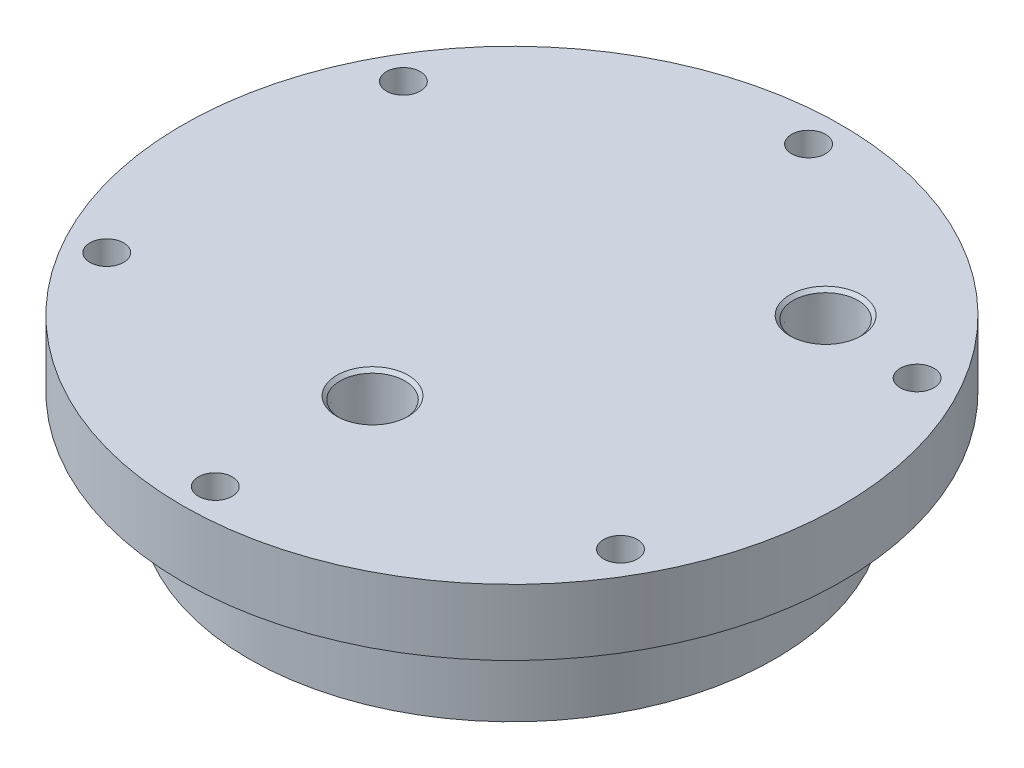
ISO-10303-21;
HEADER;
FILE_DESCRIPTION(('STEP AP214'),'2;1');
FILE_NAME('part.step','',(''),(''),'','','');
FILE_SCHEMA(('AUTOMOTIVE_DESIGN { 1 0 10303 214 1 1 1 1 }'));
ENDSEC;
DATA;
#1=APPLICATION_CONTEXT('core data for automotive mechanical design processes');
#2=APPLICATION_PROTOCOL_DEFINITION('international standard','automotive_design',2000,#1);
#3=PRODUCT_CONTEXT('',#1,'mechanical');
#4=PRODUCT('Part','Part','',(#3));
#5=PRODUCT_RELATED_PRODUCT_CATEGORY('part','',(#4));
#6=PRODUCT_DEFINITION_FORMATION('','',#4);
#7=PRODUCT_DEFINITION_CONTEXT('part definition',#1,'design');
#8=PRODUCT_DEFINITION('design','',#6,#7);
#9=PRODUCT_DEFINITION_SHAPE('','',#8);
#10=(LENGTH_UNIT() NAMED_UNIT(*) SI_UNIT(.MILLI.,.METRE.));
#11=(NAMED_UNIT(*) PLANE_ANGLE_UNIT() SI_UNIT($,.RADIAN.));
#12=(NAMED_UNIT(*) SI_UNIT($,.STERADIAN.) SOLID_ANGLE_UNIT());
#13=UNCERTAINTY_MEASURE_WITH_UNIT(LENGTH_MEASURE(1.E-05),#10,'distance_accuracy_value','');
#14=(GEOMETRIC_REPRESENTATION_CONTEXT(3) GLOBAL_UNCERTAINTY_ASSIGNED_CONTEXT((#13)) GLOBAL_UNIT_ASSIGNED_CONTEXT((#10,
#11,#12)) REPRESENTATION_CONTEXT('',''));
#15=CARTESIAN_POINT('',(0.,0.,0.));
#16=DIRECTION('',(0.,0.,1.));
#17=DIRECTION('',(1.,0.,0.));
#18=AXIS2_PLACEMENT_3D('',#15,#16,#17);
#19=CARTESIAN_POINT('',(0.,0.,0.));
#20=DIRECTION('',(0.,1.,0.));
#21=DIRECTION('',(0.,0.,1.));
#22=AXIS2_PLACEMENT_3D('',#19,#20,#21);
#23=PLANE('',#22);
#24=CARTESIAN_POINT('',(0.,0.,0.));
#25=DIRECTION('',(0.,-1.,0.));
#26=DIRECTION('',(0.,0.,-1.));
#27=AXIS2_PLACEMENT_3D('',#24,#25,#26);
#28=CIRCLE('',#27,36.3855);
#29=CARTESIAN_POINT('',(0.,0.,-36.3855));
#30=VERTEX_POINT('',#29);
#31=EDGE_CURVE('E98',#30,#30,#28,.T.);
#32=ORIENTED_EDGE('',*,*,#31,.T.);
#33=EDGE_LOOP('',(#32));
#34=FACE_BOUND('',#33,.T.);
#35=CARTESIAN_POINT('',(0.,0.,0.));
#36=DIRECTION('',(0.,-1.,0.));
#37=DIRECTION('',(0.,0.,-1.));
#38=AXIS2_PLACEMENT_3D('',#35,#36,#37);
#39=CIRCLE('',#38,33.2105);
#40=CARTESIAN_POINT('',(0.,0.,-33.2105));
#41=VERTEX_POINT('',#40);
#42=EDGE_CURVE('E95',#41,#41,#39,.T.);
#43=ORIENTED_EDGE('',*,*,#42,.F.);
#44=EDGE_LOOP('',(#43));
#45=FACE_BOUND('',#44,.T.);
#46=ADVANCED_FACE('F30',(#34,#45),#23,.F.);
#47=CARTESIAN_POINT('',(0.,0.,0.));
#48=DIRECTION('',(0.,-1.,0.));
#49=DIRECTION('',(0.,0.,-1.));
#50=AXIS2_PLACEMENT_3D('',#47,#48,#49);
#51=CYLINDRICAL_SURFACE('',#50,20.5105);
#52=CARTESIAN_POINT('',(0.,0.,0.));
#53=DIRECTION('',(0.,-1.,0.));
#54=DIRECTION('',(0.,0.,-1.));
#55=AXIS2_PLACEMENT_3D('',#52,#53,#54);
#56=CIRCLE('',#55,20.5105);
#57=CARTESIAN_POINT('',(0.,0.,-20.5105));
#58=VERTEX_POINT('',#57);
#59=EDGE_CURVE('E86',#58,#58,#56,.T.);
#60=ORIENTED_EDGE('',*,*,#59,.F.);
#61=EDGE_LOOP('',(#60));
#62=FACE_BOUND('',#61,.T.);
#63=CARTESIAN_POINT('',(0.,15.875,0.));
#64=DIRECTION('',(0.,-1.,0.));
#65=DIRECTION('',(0.,0.,-1.));
#66=AXIS2_PLACEMENT_3D('',#63,#64,#65);
#67=CIRCLE('',#66,20.5105);
#68=CARTESIAN_POINT('',(0.,15.875,-20.5105));
#69=VERTEX_POINT('',#68);
#70=EDGE_CURVE('E89',#69,#69,#67,.T.);
#71=ORIENTED_EDGE('',*,*,#70,.T.);
#72=EDGE_LOOP('',(#71));
#73=FACE_BOUND('',#72,.T.);
#74=ADVANCED_FACE('F188',(#62,#73),#51,.T.);
#75=CARTESIAN_POINT('',(20.5105,15.875,0.));
#76=DIRECTION('',(0.,1.,0.));
#77=DIRECTION('',(0.,0.,1.));
#78=AXIS2_PLACEMENT_3D('',#75,#76,#77);
#79=PLANE('',#78);
#80=CARTESIAN_POINT('',(0.,15.875,26.8605));
#81=DIRECTION('',(0.,1.,0.));
#82=DIRECTION('',(0.,0.,1.));
#83=AXIS2_PLACEMENT_3D('',#80,#81,#82);
#84=CIRCLE('',#83,5.5626);
#85=CARTESIAN_POINT('',(0.,15.875,32.4231));
#86=VERTEX_POINT('',#85);
#87=EDGE_CURVE('E125',#86,#86,#84,.T.);
#88=ORIENTED_EDGE('',*,*,#87,.T.);
#89=EDGE_LOOP('',(#88));
#90=FACE_BOUND('',#89,.T.);
#91=ORIENTED_EDGE('',*,*,#70,.F.);
#92=EDGE_LOOP('',(#91));
#93=FACE_BOUND('',#92,.T.);
#94=CARTESIAN_POINT('',(0.,15.875,0.));
#95=DIRECTION('',(0.,-1.,0.));
#96=DIRECTION('',(0.,0.,-1.));
#97=AXIS2_PLACEMENT_3D('',#94,#95,#96);
#98=CIRCLE('',#97,33.2105);
#99=CARTESIAN_POINT('',(0.,15.875,-33.2105));
#100=VERTEX_POINT('',#99);
#101=EDGE_CURVE('E92',#100,#100,#98,.T.);
#102=ORIENTED_EDGE('',*,*,#101,.T.);
#103=EDGE_LOOP('',(#102));
#104=FACE_BOUND('',#103,.T.);
#105=ADVANCED_FACE('F194',(#90,#93,#104),#79,.F.);
#106=CARTESIAN_POINT('',(0.,0.,0.));
#107=DIRECTION('',(0.,-1.,0.));
#108=DIRECTION('',(0.,0.,-1.));
#109=AXIS2_PLACEMENT_3D('',#106,#107,#108);
#110=CYLINDRICAL_SURFACE('',#109,33.2105);
#111=ORIENTED_EDGE('',*,*,#101,.F.);
#112=EDGE_LOOP('',(#111));
#113=FACE_BOUND('',#112,.T.);
#114=ORIENTED_EDGE('',*,*,#42,.T.);
#115=EDGE_LOOP('',(#114));
#116=FACE_BOUND('',#115,.T.);
#117=ADVANCED_FACE('F200',(#113,#116),#110,.F.);
#118=ORIENTED_EDGE('',*,*,#59,.T.);
#119=EDGE_LOOP('',(#118));
#120=FACE_BOUND('',#119,.T.);
#121=ADVANCED_FACE('F190',(#120),#23,.F.);
#122=CARTESIAN_POINT('',(0.,0.,0.));
#123=DIRECTION('',(0.,-1.,0.));
#124=DIRECTION('',(0.,0.,-1.));
#125=AXIS2_PLACEMENT_3D('',#122,#123,#124);
#126=CYLINDRICAL_SURFACE('',#125,36.3855);
#127=ORIENTED_EDGE('',*,*,#31,.F.);
#128=EDGE_LOOP('',(#127));
#129=FACE_BOUND('',#128,.T.);
#130=CARTESIAN_POINT('',(0.,15.875,0.));
#131=DIRECTION('',(0.,-1.,0.));
#132=DIRECTION('',(0.,0.,-1.));
#133=AXIS2_PLACEMENT_3D('',#130,#131,#132);
#134=CIRCLE('',#133,36.3855);
#135=CARTESIAN_POINT('',(0.,15.875,-36.3855));
#136=VERTEX_POINT('',#135);
#137=EDGE_CURVE('E101',#136,#136,#134,.T.);
#138=ORIENTED_EDGE('',*,*,#137,.T.);
#139=EDGE_LOOP('',(#138));
#140=FACE_BOUND('',#139,.T.);
#141=ADVANCED_FACE('F199',(#129,#140),#126,.T.);
#142=CARTESIAN_POINT('',(36.3855,15.875,0.));
#143=DIRECTION('',(0.,1.,0.));
#144=DIRECTION('',(0.,0.,1.));
#145=AXIS2_PLACEMENT_3D('',#142,#143,#144);
#146=PLANE('',#145);
#147=CARTESIAN_POINT('',(30.2185618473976,15.875,-30.2185618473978));
#148=DIRECTION('',(0.,1.,0.));
#149=DIRECTION('',(0.,0.,1.));
#150=AXIS2_PLACEMENT_3D('',#147,#148,#149);
#151=CIRCLE('',#150,5.5626);
#152=CARTESIAN_POINT('',(30.2185618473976,15.875,-24.6559618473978));
#153=VERTEX_POINT('',#152);
#154=EDGE_CURVE('E110',#153,#153,#151,.T.);
#155=ORIENTED_EDGE('',*,*,#154,.T.);
#156=EDGE_LOOP('',(#155));
#157=FACE_BOUND('',#156,.T.);
#158=ORIENTED_EDGE('',*,*,#137,.F.);
#159=EDGE_LOOP('',(#158));
#160=FACE_BOUND('',#159,.T.);
#161=CARTESIAN_POINT('',(0.,15.875,0.));
#162=DIRECTION('',(0.,-1.,0.));
#163=DIRECTION('',(0.,0.,-1.));
#164=AXIS2_PLACEMENT_3D('',#161,#162,#163);
#165=CIRCLE('',#164,49.0855);
#166=CARTESIAN_POINT('',(0.,15.875,-49.0855));
#167=VERTEX_POINT('',#166);
#168=EDGE_CURVE('E104',#167,#167,#165,.T.);
#169=ORIENTED_EDGE('',*,*,#168,.T.);
#170=EDGE_LOOP('',(#169));
#171=FACE_BOUND('',#170,.T.);
#172=ADVANCED_FACE('F215',(#157,#160,#171),#146,.F.);
#173=CARTESIAN_POINT('',(0.,0.,0.));
#174=DIRECTION('',(0.,-1.,0.));
#175=DIRECTION('',(0.,0.,-1.));
#176=AXIS2_PLACEMENT_3D('',#173,#174,#175);
#177=CYLINDRICAL_SURFACE('',#176,49.0855);
#178=ORIENTED_EDGE('',*,*,#168,.F.);
#179=EDGE_LOOP('',(#178));
#180=FACE_BOUND('',#179,.T.);
#181=CARTESIAN_POINT('',(0.,0.,0.));
#182=DIRECTION('',(0.,-1.,0.));
#183=DIRECTION('',(0.,0.,-1.));
#184=AXIS2_PLACEMENT_3D('',#181,#182,#183);
#185=CIRCLE('',#184,49.0855);
#186=CARTESIAN_POINT('',(0.,0.,-49.0855));
#187=VERTEX_POINT('',#186);
#188=EDGE_CURVE('E107',#187,#187,#185,.T.);
#189=ORIENTED_EDGE('',*,*,#188,.T.);
#190=EDGE_LOOP('',(#189));
#191=FACE_BOUND('',#190,.T.);
#192=ADVANCED_FACE('F147',(#180,#191),#177,.F.);
#193=CARTESIAN_POINT('',(63.5,32.004,0.));
#194=DIRECTION('',(0.,-1.,0.));
#195=DIRECTION('',(0.,0.,-1.));
#196=AXIS2_PLACEMENT_3D('',#193,#194,#195);
#197=PLANE('',#196);
#198=CARTESIAN_POINT('',(0.,32.004,26.8605));
#199=DIRECTION('',(0.,1.,0.));
#200=DIRECTION('',(0.,0.,1.));
#201=AXIS2_PLACEMENT_3D('',#198,#199,#200);
#202=CIRCLE('',#201,6.8752847);
#203=CARTESIAN_POINT('',(0.,32.004,33.7357847));
#204=VERTEX_POINT('',#203);
#205=EDGE_CURVE('E137',#204,#204,#202,.T.);
#206=ORIENTED_EDGE('',*,*,#205,.F.);
#207=EDGE_LOOP('',(#206));
#208=FACE_BOUND('',#207,.T.);
#209=CARTESIAN_POINT('',(30.2185618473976,32.004,-30.2185618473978));
#210=DIRECTION('',(0.,1.,0.));
#211=DIRECTION('',(0.,0.,1.));
#212=AXIS2_PLACEMENT_3D('',#209,#210,#211);
#213=CIRCLE('',#212,6.8752847);
#214=CARTESIAN_POINT('',(30.2185618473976,32.004,-23.3432771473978));
#215=VERTEX_POINT('',#214);
#216=EDGE_CURVE('E122',#215,#215,#213,.T.);
#217=ORIENTED_EDGE('',*,*,#216,.F.);
#218=EDGE_LOOP('',(#217));
#219=FACE_BOUND('',#218,.T.);
#220=CARTESIAN_POINT('',(-49.4933518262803,32.004,28.5750000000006));
#221=DIRECTION('',(0.,-1.,0.));
#222=DIRECTION('',(0.866025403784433,0.,-0.50000000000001));
#223=AXIS2_PLACEMENT_3D('',#220,#221,#222);
#224=CIRCLE('',#223,3.26389999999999);
#225=CARTESIAN_POINT('',(-46.6667315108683,32.004,26.9430500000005));
#226=VERTEX_POINT('',#225);
#227=EDGE_CURVE('E83',#226,#226,#224,.T.);
#228=ORIENTED_EDGE('',*,*,#227,.T.);
#229=EDGE_LOOP('',(#228));
#230=FACE_BOUND('',#229,.T.);
#231=CARTESIAN_POINT('',(-49.4933518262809,32.004,-28.5749999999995));
#232=DIRECTION('',(0.,-1.,0.));
#233=DIRECTION('',(0.866025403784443,0.,0.499999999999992));
#234=AXIS2_PLACEMENT_3D('',#231,#232,#233);
#235=CIRCLE('',#234,3.26389999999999);
#236=CARTESIAN_POINT('',(-46.6667315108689,32.004,-26.9430499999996));
#237=VERTEX_POINT('',#236);
#238=EDGE_CURVE('E77',#237,#237,#235,.T.);
#239=ORIENTED_EDGE('',*,*,#238,.T.);
#240=EDGE_LOOP('',(#239));
#241=FACE_BOUND('',#240,.T.);
#242=CARTESIAN_POINT('',(-3.99076548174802E-13,32.004,-57.15));
#243=DIRECTION('',(0.,-1.,0.));
#244=DIRECTION('',(0.,0.,1.));
#245=AXIS2_PLACEMENT_3D('',#242,#243,#244);
#246=CIRCLE('',#245,3.26389999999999);
#247=CARTESIAN_POINT('',(-3.76284843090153E-13,32.004,-53.8861));
#248=VERTEX_POINT('',#247);
#249=EDGE_CURVE('E71',#248,#248,#246,.T.);
#250=ORIENTED_EDGE('',*,*,#249,.T.);
#251=EDGE_LOOP('',(#250));
#252=FACE_BOUND('',#251,.T.);
#253=CARTESIAN_POINT('',(49.4933518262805,32.004,-28.5750000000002));
#254=DIRECTION('',(0.,-1.,0.));
#255=DIRECTION('',(-0.866025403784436,0.,0.500000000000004));
#256=AXIS2_PLACEMENT_3D('',#253,#254,#255);
#257=CIRCLE('',#256,3.26389999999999);
#258=CARTESIAN_POINT('',(46.6667315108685,32.004,-26.9430500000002));
#259=VERTEX_POINT('',#258);
#260=EDGE_CURVE('E65',#259,#259,#257,.T.);
#261=ORIENTED_EDGE('',*,*,#260,.T.);
#262=EDGE_LOOP('',(#261));
#263=FACE_BOUND('',#262,.T.);
#264=CARTESIAN_POINT('',(49.4933518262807,32.004,28.5749999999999));
#265=DIRECTION('',(0.,-1.,0.));
#266=DIRECTION('',(-0.86602540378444,0.,-0.499999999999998));
#267=AXIS2_PLACEMENT_3D('',#264,#265,#266);
#268=CIRCLE('',#267,3.26389999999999);
#269=CARTESIAN_POINT('',(46.6667315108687,32.004,26.9430499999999));
#270=VERTEX_POINT('',#269);
#271=EDGE_CURVE('E59',#270,#270,#268,.T.);
#272=ORIENTED_EDGE('',*,*,#271,.T.);
#273=EDGE_LOOP('',(#272));
#274=FACE_BOUND('',#273,.T.);
#275=CARTESIAN_POINT('',(0.,32.004,57.15));
#276=DIRECTION('',(0.,-1.,0.));
#277=DIRECTION('',(0.,0.,-1.));
#278=AXIS2_PLACEMENT_3D('',#275,#276,#277);
#279=CIRCLE('',#278,3.26389999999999);
#280=CARTESIAN_POINT('',(0.,32.004,53.8861));
#281=VERTEX_POINT('',#280);
#282=EDGE_CURVE('E50',#281,#281,#279,.T.);
#283=ORIENTED_EDGE('',*,*,#282,.T.);
#284=EDGE_LOOP('',(#283));
#285=FACE_BOUND('',#284,.T.);
#286=CARTESIAN_POINT('',(0.,32.004,0.));
#287=DIRECTION('',(0.,1.,0.));
#288=DIRECTION('',(0.,0.,1.));
#289=AXIS2_PLACEMENT_3D('',#286,#287,#288);
#290=CIRCLE('',#289,63.5);
#291=CARTESIAN_POINT('',(0.,32.004,63.5));
#292=VERTEX_POINT('',#291);
#293=EDGE_CURVE('E45',#292,#292,#290,.T.);
#294=ORIENTED_EDGE('',*,*,#293,.T.);
#295=EDGE_LOOP('',(#294));
#296=FACE_BOUND('',#295,.T.);
#297=ADVANCED_FACE('F143',(#208,#219,#230,#241,#252,#263,#274,#285,#296),#197,.F.);
#298=CARTESIAN_POINT('',(0.,0.,0.));
#299=DIRECTION('',(0.,1.,0.));
#300=DIRECTION('',(0.,0.,1.));
#301=AXIS2_PLACEMENT_3D('',#298,#299,#300);
#302=CYLINDRICAL_SURFACE('',#301,63.5);
#303=ORIENTED_EDGE('',*,*,#293,.F.);
#304=EDGE_LOOP('',(#303));
#305=FACE_BOUND('',#304,.T.);
#306=CARTESIAN_POINT('',(0.,19.304,0.));
#307=DIRECTION('',(0.,1.,0.));
#308=DIRECTION('',(0.,0.,1.));
#309=AXIS2_PLACEMENT_3D('',#306,#307,#308);
#310=CIRCLE('',#309,63.5);
#311=CARTESIAN_POINT('',(0.,19.304,63.5));
#312=VERTEX_POINT('',#311);
#313=EDGE_CURVE('E41',#312,#312,#310,.T.);
#314=ORIENTED_EDGE('',*,*,#313,.T.);
#315=EDGE_LOOP('',(#314));
#316=FACE_BOUND('',#315,.T.);
#317=ADVANCED_FACE('F146',(#305,#316),#302,.T.);
#318=CARTESIAN_POINT('',(0.,19.304,57.15));
#319=DIRECTION('',(0.,-1.,0.));
#320=DIRECTION('',(0.,0.,-1.));
#321=AXIS2_PLACEMENT_3D('',#318,#319,#320);
#322=CYLINDRICAL_SURFACE('',#321,3.26389999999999);
#323=ORIENTED_EDGE('',*,*,#282,.F.);
#324=EDGE_LOOP('',(#323));
#325=FACE_BOUND('',#324,.T.);
#326=CARTESIAN_POINT('',(0.,19.304,57.15));
#327=DIRECTION('',(0.,-1.,0.));
#328=DIRECTION('',(0.,0.,-1.));
#329=AXIS2_PLACEMENT_3D('',#326,#327,#328);
#330=CIRCLE('',#329,3.26389999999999);
#331=CARTESIAN_POINT('',(0.,19.304,53.8861));
#332=VERTEX_POINT('',#331);
#333=EDGE_CURVE('E53',#332,#332,#330,.T.);
#334=ORIENTED_EDGE('',*,*,#333,.T.);
#335=EDGE_LOOP('',(#334));
#336=FACE_BOUND('',#335,.T.);
#337=ADVANCED_FACE('F167',(#325,#336),#322,.F.);
#338=CARTESIAN_POINT('',(49.4933518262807,19.304,28.5749999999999));
#339=DIRECTION('',(0.,-1.,0.));
#340=DIRECTION('',(-0.86602540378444,0.,-0.499999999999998));
#341=AXIS2_PLACEMENT_3D('',#338,#339,#340);
#342=CYLINDRICAL_SURFACE('',#341,3.26389999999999);
#343=ORIENTED_EDGE('',*,*,#271,.F.);
#344=EDGE_LOOP('',(#343));
#345=FACE_BOUND('',#344,.T.);
#346=CARTESIAN_POINT('',(49.4933518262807,19.304,28.5749999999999));
#347=DIRECTION('',(0.,-1.,0.));
#348=DIRECTION('',(-0.86602540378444,0.,-0.499999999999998));
#349=AXIS2_PLACEMENT_3D('',#346,#347,#348);
#350=CIRCLE('',#349,3.26389999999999);
#351=CARTESIAN_POINT('',(46.6667315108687,19.304,26.9430499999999));
#352=VERTEX_POINT('',#351);
#353=EDGE_CURVE('E56',#352,#352,#350,.T.);
#354=ORIENTED_EDGE('',*,*,#353,.T.);
#355=EDGE_LOOP('',(#354));
#356=FACE_BOUND('',#355,.T.);
#357=ADVANCED_FACE('F245',(#345,#356),#342,.F.);
#358=CARTESIAN_POINT('',(49.4933518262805,19.304,-28.5750000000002));
#359=DIRECTION('',(0.,-1.,0.));
#360=DIRECTION('',(-0.866025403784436,0.,0.500000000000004));
#361=AXIS2_PLACEMENT_3D('',#358,#359,#360);
#362=CYLINDRICAL_SURFACE('',#361,3.26389999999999);
#363=ORIENTED_EDGE('',*,*,#260,.F.);
#364=EDGE_LOOP('',(#363));
#365=FACE_BOUND('',#364,.T.);
#366=CARTESIAN_POINT('',(49.4933518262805,19.304,-28.5750000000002));
#367=DIRECTION('',(0.,-1.,0.));
#368=DIRECTION('',(-0.866025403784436,0.,0.500000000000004));
#369=AXIS2_PLACEMENT_3D('',#366,#367,#368);
#370=CIRCLE('',#369,3.26389999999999);
#371=CARTESIAN_POINT('',(46.6667315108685,19.304,-26.9430500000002));
#372=VERTEX_POINT('',#371);
#373=EDGE_CURVE('E62',#372,#372,#370,.T.);
#374=ORIENTED_EDGE('',*,*,#373,.T.);
#375=EDGE_LOOP('',(#374));
#376=FACE_BOUND('',#375,.T.);
#377=ADVANCED_FACE('F241',(#365,#376),#362,.F.);
#378=CARTESIAN_POINT('',(-3.99076548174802E-13,19.304,-57.15));
#379=DIRECTION('',(0.,-1.,0.));
#380=DIRECTION('',(0.,0.,1.));
#381=AXIS2_PLACEMENT_3D('',#378,#379,#380);
#382=CYLINDRICAL_SURFACE('',#381,3.26389999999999);
#383=ORIENTED_EDGE('',*,*,#249,.F.);
#384=EDGE_LOOP('',(#383));
#385=FACE_BOUND('',#384,.T.);
#386=CARTESIAN_POINT('',(-3.99076548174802E-13,19.304,-57.15));
#387=DIRECTION('',(0.,-1.,0.));
#388=DIRECTION('',(0.,0.,1.));
#389=AXIS2_PLACEMENT_3D('',#386,#387,#388);
#390=CIRCLE('',#389,3.26389999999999);
#391=CARTESIAN_POINT('',(-3.76284843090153E-13,19.304,-53.8861));
#392=VERTEX_POINT('',#391);
#393=EDGE_CURVE('E68',#392,#392,#390,.T.);
#394=ORIENTED_EDGE('',*,*,#393,.T.);
#395=EDGE_LOOP('',(#394));
#396=FACE_BOUND('',#395,.T.);
#397=ADVANCED_FACE('F237',(#385,#396),#382,.F.);
#398=CARTESIAN_POINT('',(-49.4933518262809,19.304,-28.5749999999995));
#399=DIRECTION('',(0.,-1.,0.));
#400=DIRECTION('',(0.866025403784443,0.,0.499999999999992));
#401=AXIS2_PLACEMENT_3D('',#398,#399,#400);
#402=CYLINDRICAL_SURFACE('',#401,3.26389999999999);
#403=ORIENTED_EDGE('',*,*,#238,.F.);
#404=EDGE_LOOP('',(#403));
#405=FACE_BOUND('',#404,.T.);
#406=CARTESIAN_POINT('',(-49.4933518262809,19.304,-28.5749999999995));
#407=DIRECTION('',(0.,-1.,0.));
#408=DIRECTION('',(0.866025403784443,0.,0.499999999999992));
#409=AXIS2_PLACEMENT_3D('',#406,#407,#408);
#410=CIRCLE('',#409,3.26389999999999);
#411=CARTESIAN_POINT('',(-46.6667315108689,19.304,-26.9430499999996));
#412=VERTEX_POINT('',#411);
#413=EDGE_CURVE('E74',#412,#412,#410,.T.);
#414=ORIENTED_EDGE('',*,*,#413,.T.);
#415=EDGE_LOOP('',(#414));
#416=FACE_BOUND('',#415,.T.);
#417=ADVANCED_FACE('F182',(#405,#416),#402,.F.);
#418=CARTESIAN_POINT('',(-49.4933518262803,19.304,28.5750000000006));
#419=DIRECTION('',(0.,-1.,0.));
#420=DIRECTION('',(0.866025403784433,0.,-0.50000000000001));
#421=AXIS2_PLACEMENT_3D('',#418,#419,#420);
#422=CYLINDRICAL_SURFACE('',#421,3.26389999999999);
#423=ORIENTED_EDGE('',*,*,#227,.F.);
#424=EDGE_LOOP('',(#423));
#425=FACE_BOUND('',#424,.T.);
#426=CARTESIAN_POINT('',(-49.4933518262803,19.304,28.5750000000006));
#427=DIRECTION('',(0.,-1.,0.));
#428=DIRECTION('',(0.866025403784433,0.,-0.50000000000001));
#429=AXIS2_PLACEMENT_3D('',#426,#427,#428);
#430=CIRCLE('',#429,3.26389999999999);
#431=CARTESIAN_POINT('',(-46.6667315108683,19.304,26.9430500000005));
#432=VERTEX_POINT('',#431);
#433=EDGE_CURVE('E80',#432,#432,#430,.T.);
#434=ORIENTED_EDGE('',*,*,#433,.T.);
#435=EDGE_LOOP('',(#434));
#436=FACE_BOUND('',#435,.T.);
#437=ADVANCED_FACE('F174',(#425,#436),#422,.F.);
#438=CARTESIAN_POINT('',(50.673,19.304,0.));
#439=DIRECTION('',(0.,1.,0.));
#440=DIRECTION('',(0.,0.,1.));
#441=AXIS2_PLACEMENT_3D('',#438,#439,#440);
#442=PLANE('',#441);
#443=ORIENTED_EDGE('',*,*,#433,.F.);
#444=EDGE_LOOP('',(#443));
#445=FACE_BOUND('',#444,.T.);
#446=ORIENTED_EDGE('',*,*,#413,.F.);
#447=EDGE_LOOP('',(#446));
#448=FACE_BOUND('',#447,.T.);
#449=ORIENTED_EDGE('',*,*,#393,.F.);
#450=EDGE_LOOP('',(#449));
#451=FACE_BOUND('',#450,.T.);
#452=ORIENTED_EDGE('',*,*,#373,.F.);
#453=EDGE_LOOP('',(#452));
#454=FACE_BOUND('',#453,.T.);
#455=ORIENTED_EDGE('',*,*,#353,.F.);
#456=EDGE_LOOP('',(#455));
#457=FACE_BOUND('',#456,.T.);
#458=ORIENTED_EDGE('',*,*,#333,.F.);
#459=EDGE_LOOP('',(#458));
#460=FACE_BOUND('',#459,.T.);
#461=ORIENTED_EDGE('',*,*,#313,.F.);
#462=EDGE_LOOP('',(#461));
#463=FACE_BOUND('',#462,.T.);
#464=CARTESIAN_POINT('',(0.,19.304,0.));
#465=DIRECTION('',(0.,1.,0.));
#466=DIRECTION('',(0.,0.,1.));
#467=AXIS2_PLACEMENT_3D('',#464,#465,#466);
#468=CIRCLE('',#467,50.673);
#469=CARTESIAN_POINT('',(0.,19.304,50.673));
#470=VERTEX_POINT('',#469);
#471=EDGE_CURVE('E37',#470,#470,#468,.T.);
#472=ORIENTED_EDGE('',*,*,#471,.T.);
#473=EDGE_LOOP('',(#472));
#474=FACE_BOUND('',#473,.T.);
#475=ADVANCED_FACE('F171',(#445,#448,#451,#454,#457,#460,#463,#474),#442,.F.);
#476=CARTESIAN_POINT('',(0.,0.,0.));
#477=DIRECTION('',(0.,1.,0.));
#478=DIRECTION('',(0.,0.,1.));
#479=AXIS2_PLACEMENT_3D('',#476,#477,#478);
#480=CYLINDRICAL_SURFACE('',#479,50.673);
#481=ORIENTED_EDGE('',*,*,#471,.F.);
#482=EDGE_LOOP('',(#481));
#483=FACE_BOUND('',#482,.T.);
#484=CARTESIAN_POINT('',(0.,0.,0.));
#485=DIRECTION('',(0.,1.,0.));
#486=DIRECTION('',(0.,0.,1.));
#487=AXIS2_PLACEMENT_3D('',#484,#485,#486);
#488=CIRCLE('',#487,50.673);
#489=CARTESIAN_POINT('',(0.,0.,50.673));
#490=VERTEX_POINT('',#489);
#491=EDGE_CURVE('E10',#490,#490,#488,.T.);
#492=ORIENTED_EDGE('',*,*,#491,.T.);
#493=EDGE_LOOP('',(#492));
#494=FACE_BOUND('',#493,.T.);
#495=ADVANCED_FACE('F173',(#483,#494),#480,.T.);
#496=ORIENTED_EDGE('',*,*,#188,.F.);
#497=EDGE_LOOP('',(#496));
#498=FACE_BOUND('',#497,.T.);
#499=ORIENTED_EDGE('',*,*,#491,.F.);
#500=EDGE_LOOP('',(#499));
#501=FACE_BOUND('',#500,.T.);
#502=ADVANCED_FACE('F32',(#498,#501),#23,.F.);
#503=CARTESIAN_POINT('',(30.2185618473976,32.004,-30.2185618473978));
#504=DIRECTION('',(0.,1.,0.));
#505=DIRECTION('',(0.,0.,1.));
#506=AXIS2_PLACEMENT_3D('',#503,#504,#505);
#507=CYLINDRICAL_SURFACE('',#506,5.5626);
#508=ORIENTED_EDGE('',*,*,#154,.F.);
#509=EDGE_LOOP('',(#508));
#510=FACE_BOUND('',#509,.T.);
#511=CARTESIAN_POINT('',(30.2185618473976,22.098,-30.2185618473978));
#512=DIRECTION('',(0.,1.,0.));
#513=DIRECTION('',(0.,0.,1.));
#514=AXIS2_PLACEMENT_3D('',#511,#512,#513);
#515=CIRCLE('',#514,5.5626);
#516=CARTESIAN_POINT('',(30.2185618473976,22.098,-24.6559618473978));
#517=VERTEX_POINT('',#516);
#518=EDGE_CURVE('E113',#517,#517,#515,.T.);
#519=ORIENTED_EDGE('',*,*,#518,.T.);
#520=EDGE_LOOP('',(#519));
#521=FACE_BOUND('',#520,.T.);
#522=ADVANCED_FACE('F203',(#510,#521),#507,.F.);
#523=CARTESIAN_POINT('',(35.7811618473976,22.098,-30.2185618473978));
#524=DIRECTION('',(0.,-1.,0.));
#525=DIRECTION('',(0.,0.,-1.));
#526=AXIS2_PLACEMENT_3D('',#523,#524,#525);
#527=PLANE('',#526);
#528=ORIENTED_EDGE('',*,*,#518,.F.);
#529=EDGE_LOOP('',(#528));
#530=FACE_BOUND('',#529,.T.);
#531=CARTESIAN_POINT('',(30.2185618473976,22.098,-30.2185618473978));
#532=DIRECTION('',(0.,1.,0.));
#533=DIRECTION('',(0.,0.,1.));
#534=AXIS2_PLACEMENT_3D('',#531,#532,#533);
#535=CIRCLE('',#534,5.96269854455);
#536=CARTESIAN_POINT('',(30.2185618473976,22.098,-24.2558633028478));
#537=VERTEX_POINT('',#536);
#538=EDGE_CURVE('E116',#537,#537,#535,.T.);
#539=ORIENTED_EDGE('',*,*,#538,.T.);
#540=EDGE_LOOP('',(#539));
#541=FACE_BOUND('',#540,.T.);
#542=ADVANCED_FACE('F208',(#530,#541),#527,.F.);
#543=CARTESIAN_POINT('',(30.2185618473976,31.369,-30.2185618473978));
#544=DIRECTION('',(0.,1.,0.));
#545=DIRECTION('',(0.,0.,1.));
#546=AXIS2_PLACEMENT_3D('',#543,#544,#545);
#547=CONICAL_SURFACE('',#546,6.2402847,0.029932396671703);
#548=ORIENTED_EDGE('',*,*,#538,.F.);
#549=EDGE_LOOP('',(#548));
#550=FACE_BOUND('',#549,.T.);
#551=CARTESIAN_POINT('',(30.2185618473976,31.369,-30.2185618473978));
#552=DIRECTION('',(0.,1.,0.));
#553=DIRECTION('',(0.,0.,1.));
#554=AXIS2_PLACEMENT_3D('',#551,#552,#553);
#555=CIRCLE('',#554,6.2402847);
#556=CARTESIAN_POINT('',(30.2185618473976,31.369,-23.9782771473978));
#557=VERTEX_POINT('',#556);
#558=EDGE_CURVE('E119',#557,#557,#555,.T.);
#559=ORIENTED_EDGE('',*,*,#558,.T.);
#560=EDGE_LOOP('',(#559));
#561=FACE_BOUND('',#560,.T.);
#562=ADVANCED_FACE('F350',(#550,#561),#547,.F.);
#563=CARTESIAN_POINT('',(30.2185618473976,32.004,-30.2185618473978));
#564=DIRECTION('',(0.,1.,0.));
#565=DIRECTION('',(0.,0.,1.));
#566=AXIS2_PLACEMENT_3D('',#563,#564,#565);
#567=CONICAL_SURFACE('',#566,6.8752847,0.785398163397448);
#568=ORIENTED_EDGE('',*,*,#558,.F.);
#569=EDGE_LOOP('',(#568));
#570=FACE_BOUND('',#569,.T.);
#571=ORIENTED_EDGE('',*,*,#216,.T.);
#572=EDGE_LOOP('',(#571));
#573=FACE_BOUND('',#572,.T.);
#574=ADVANCED_FACE('F360',(#570,#573),#567,.F.);
#575=CARTESIAN_POINT('',(0.,32.004,26.8605));
#576=DIRECTION('',(0.,1.,0.));
#577=DIRECTION('',(0.,0.,1.));
#578=AXIS2_PLACEMENT_3D('',#575,#576,#577);
#579=CYLINDRICAL_SURFACE('',#578,5.5626);
#580=ORIENTED_EDGE('',*,*,#87,.F.);
#581=EDGE_LOOP('',(#580));
#582=FACE_BOUND('',#581,.T.);
#583=CARTESIAN_POINT('',(0.,22.098,26.8605));
#584=DIRECTION('',(0.,1.,0.));
#585=DIRECTION('',(0.,0.,1.));
#586=AXIS2_PLACEMENT_3D('',#583,#584,#585);
#587=CIRCLE('',#586,5.5626);
#588=CARTESIAN_POINT('',(0.,22.098,32.4231));
#589=VERTEX_POINT('',#588);
#590=EDGE_CURVE('E128',#589,#589,#587,.T.);
#591=ORIENTED_EDGE('',*,*,#590,.T.);
#592=EDGE_LOOP('',(#591));
#593=FACE_BOUND('',#592,.T.);
#594=ADVANCED_FACE('F371',(#582,#593),#579,.F.);
#595=CARTESIAN_POINT('',(5.5626,22.098,26.8605));
#596=DIRECTION('',(0.,-1.,0.));
#597=DIRECTION('',(0.,0.,-1.));
#598=AXIS2_PLACEMENT_3D('',#595,#596,#597);
#599=PLANE('',#598);
#600=ORIENTED_EDGE('',*,*,#590,.F.);
#601=EDGE_LOOP('',(#600));
#602=FACE_BOUND('',#601,.T.);
#603=CARTESIAN_POINT('',(0.,22.098,26.8605));
#604=DIRECTION('',(0.,1.,0.));
#605=DIRECTION('',(0.,0.,1.));
#606=AXIS2_PLACEMENT_3D('',#603,#604,#605);
#607=CIRCLE('',#606,5.96269854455);
#608=CARTESIAN_POINT('',(0.,22.098,32.82319854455));
#609=VERTEX_POINT('',#608);
#610=EDGE_CURVE('E131',#609,#609,#607,.T.);
#611=ORIENTED_EDGE('',*,*,#610,.T.);
#612=EDGE_LOOP('',(#611));
#613=FACE_BOUND('',#612,.T.);
#614=ADVANCED_FACE('F381',(#602,#613),#599,.F.);
#615=CARTESIAN_POINT('',(0.,31.369,26.8605));
#616=DIRECTION('',(0.,1.,0.));
#617=DIRECTION('',(0.,0.,1.));
#618=AXIS2_PLACEMENT_3D('',#615,#616,#617);
#619=CONICAL_SURFACE('',#618,6.2402847,0.029932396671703);
#620=ORIENTED_EDGE('',*,*,#610,.F.);
#621=EDGE_LOOP('',(#620));
#622=FACE_BOUND('',#621,.T.);
#623=CARTESIAN_POINT('',(0.,31.369,26.8605));
#624=DIRECTION('',(0.,1.,0.));
#625=DIRECTION('',(0.,0.,1.));
#626=AXIS2_PLACEMENT_3D('',#623,#624,#625);
#627=CIRCLE('',#626,6.2402847);
#628=CARTESIAN_POINT('',(0.,31.369,33.1007847));
#629=VERTEX_POINT('',#628);
#630=EDGE_CURVE('E134',#629,#629,#627,.T.);
#631=ORIENTED_EDGE('',*,*,#630,.T.);
#632=EDGE_LOOP('',(#631));
#633=FACE_BOUND('',#632,.T.);
#634=ADVANCED_FACE('F391',(#622,#633),#619,.F.);
#635=CARTESIAN_POINT('',(0.,32.004,26.8605));
#636=DIRECTION('',(0.,1.,0.));
#637=DIRECTION('',(0.,0.,1.));
#638=AXIS2_PLACEMENT_3D('',#635,#636,#637);
#639=CONICAL_SURFACE('',#638,6.8752847,0.785398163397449);
#640=ORIENTED_EDGE('',*,*,#630,.F.);
#641=EDGE_LOOP('',(#640));
#642=FACE_BOUND('',#641,.T.);
#643=ORIENTED_EDGE('',*,*,#205,.T.);
#644=EDGE_LOOP('',(#643));
#645=FACE_BOUND('',#644,.T.);
#646=ADVANCED_FACE('F141',(#642,#645),#639,.F.);
#647=CLOSED_SHELL('',(#46,#74,#105,#117,#121,#141,#172,#192,#297,#317,#337,#357,#377,#397,#417,
#437,#475,#495,#502,#522,#542,#562,#574,#594,#614,#634,#646));
#648=MANIFOLD_SOLID_BREP('B2',#647);
#649=ADVANCED_BREP_SHAPE_REPRESENTATION('',(#18,#648),#14);
#650=SHAPE_DEFINITION_REPRESENTATION(#9,#649);
ENDSEC;
END-ISO-10303-21;
